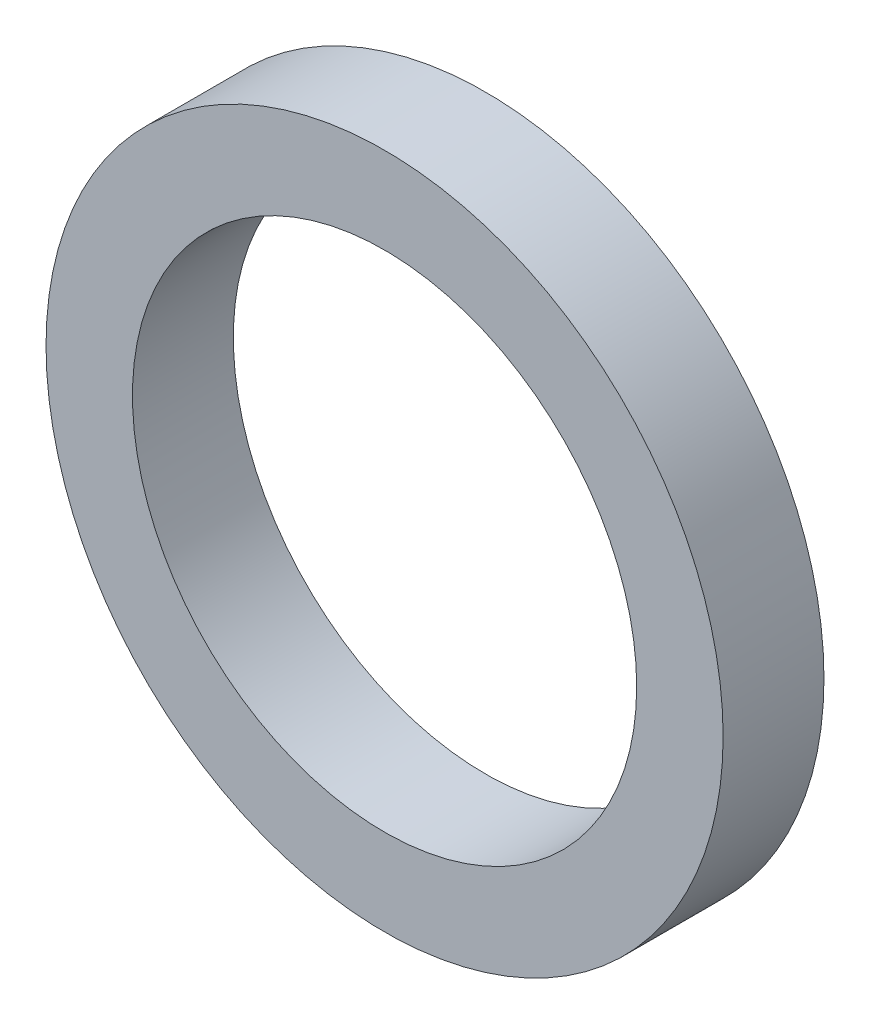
from build123d import *

# Parameters (mm, degrees)
SKETCH_1_R      = 23.5
SKETCH_1_R_2    = 17.5
EXTRUDE_1_DEPTH = 7


with BuildPart() as part:
    # Sketch 1 → Extrude 1 (new body)
    with BuildSketch(Plane.XY):
        Circle(SKETCH_1_R)
        Circle(SKETCH_1_R_2, mode=Mode.SUBTRACT)
    extrude(amount=EXTRUDE_1_DEPTH)


solid = part.part
